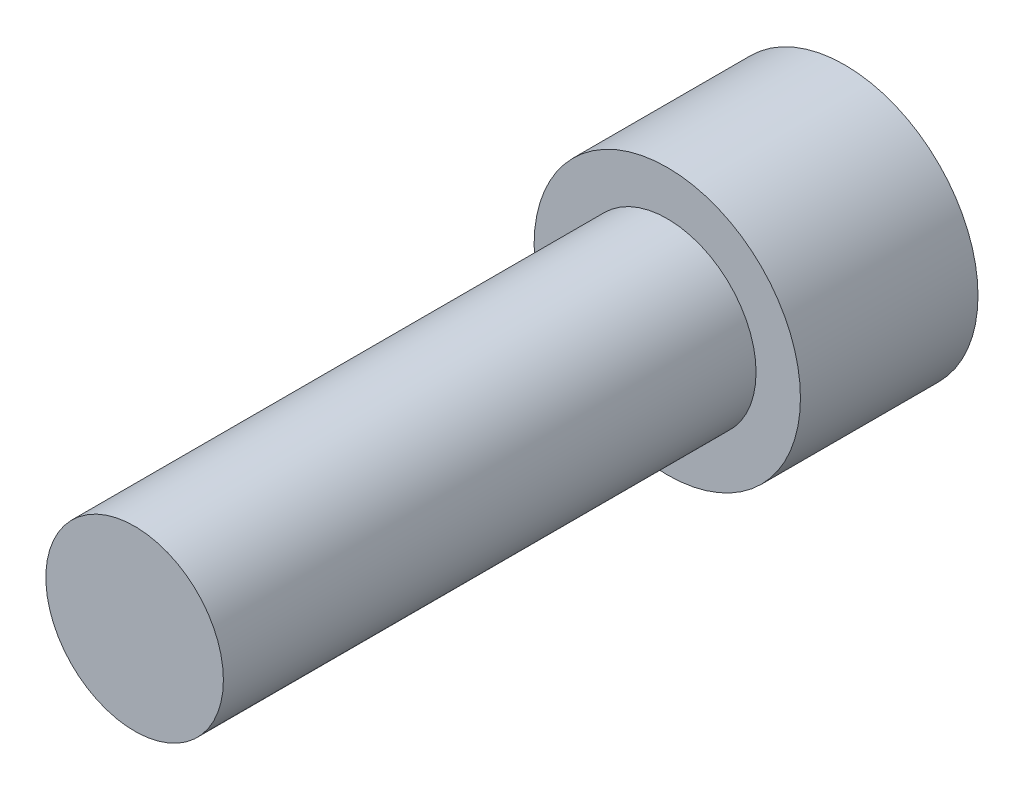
ISO-10303-21;
HEADER;
FILE_DESCRIPTION(('STEP AP214'),'2;1');
FILE_NAME('part.step','',(''),(''),'','','');
FILE_SCHEMA(('AUTOMOTIVE_DESIGN { 1 0 10303 214 1 1 1 1 }'));
ENDSEC;
DATA;
#1=APPLICATION_CONTEXT('core data for automotive mechanical design processes');
#2=APPLICATION_PROTOCOL_DEFINITION('international standard','automotive_design',2000,#1);
#3=PRODUCT_CONTEXT('',#1,'mechanical');
#4=PRODUCT('Part','Part','',(#3));
#5=PRODUCT_RELATED_PRODUCT_CATEGORY('part','',(#4));
#6=PRODUCT_DEFINITION_FORMATION('','',#4);
#7=PRODUCT_DEFINITION_CONTEXT('part definition',#1,'design');
#8=PRODUCT_DEFINITION('design','',#6,#7);
#9=PRODUCT_DEFINITION_SHAPE('','',#8);
#10=(LENGTH_UNIT() NAMED_UNIT(*) SI_UNIT(.MILLI.,.METRE.));
#11=(NAMED_UNIT(*) PLANE_ANGLE_UNIT() SI_UNIT($,.RADIAN.));
#12=(NAMED_UNIT(*) SI_UNIT($,.STERADIAN.) SOLID_ANGLE_UNIT());
#13=UNCERTAINTY_MEASURE_WITH_UNIT(LENGTH_MEASURE(1.E-05),#10,'distance_accuracy_value','');
#14=(GEOMETRIC_REPRESENTATION_CONTEXT(3) GLOBAL_UNCERTAINTY_ASSIGNED_CONTEXT((#13)) GLOBAL_UNIT_ASSIGNED_CONTEXT((#10,
#11,#12)) REPRESENTATION_CONTEXT('',''));
#15=CARTESIAN_POINT('',(0.,0.,0.));
#16=DIRECTION('',(0.,0.,1.));
#17=DIRECTION('',(1.,0.,0.));
#18=AXIS2_PLACEMENT_3D('',#15,#16,#17);
#19=CARTESIAN_POINT('',(0.,-4.7625,-6.35));
#20=DIRECTION('',(0.,0.,-1.));
#21=DIRECTION('',(-1.,0.,0.));
#22=AXIS2_PLACEMENT_3D('',#19,#20,#21);
#23=PLANE('',#22);
#24=DIRECTION('',(0.866025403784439,-0.5,0.));
#25=VECTOR('',#24,1.);
#26=CARTESIAN_POINT('',(0.,2.7569630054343,-6.35));
#27=LINE('',#26,#25);
#28=CARTESIAN_POINT('',(0.,2.7569630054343,-6.35));
#29=VERTEX_POINT('',#28);
#30=CARTESIAN_POINT('',(2.3876,1.37848150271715,-6.35));
#31=VERTEX_POINT('',#30);
#32=EDGE_CURVE('E46',#29,#31,#27,.T.);
#33=ORIENTED_EDGE('',*,*,#32,.F.);
#34=DIRECTION('',(0.866025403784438,0.5,0.));
#35=VECTOR('',#34,1.);
#36=CARTESIAN_POINT('',(-2.3876,1.37848150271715,-6.35));
#37=LINE('',#36,#35);
#38=CARTESIAN_POINT('',(-2.3876,1.37848150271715,-6.35));
#39=VERTEX_POINT('',#38);
#40=EDGE_CURVE('E129',#39,#29,#37,.T.);
#41=ORIENTED_EDGE('',*,*,#40,.F.);
#42=DIRECTION('',(0.,1.,0.));
#43=VECTOR('',#42,1.);
#44=CARTESIAN_POINT('',(-2.3876,-1.37848150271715,-6.35));
#45=LINE('',#44,#43);
#46=CARTESIAN_POINT('',(-2.3876,-1.37848150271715,-6.35));
#47=VERTEX_POINT('',#46);
#48=EDGE_CURVE('E127',#47,#39,#45,.T.);
#49=ORIENTED_EDGE('',*,*,#48,.F.);
#50=DIRECTION('',(-0.866025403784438,0.5,0.));
#51=VECTOR('',#50,1.);
#52=CARTESIAN_POINT('',(0.,-2.7569630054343,-6.35));
#53=LINE('',#52,#51);
#54=CARTESIAN_POINT('',(0.,-2.7569630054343,-6.35));
#55=VERTEX_POINT('',#54);
#56=EDGE_CURVE('E94',#55,#47,#53,.T.);
#57=ORIENTED_EDGE('',*,*,#56,.F.);
#58=DIRECTION('',(-0.866025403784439,-0.5,0.));
#59=VECTOR('',#58,1.);
#60=CARTESIAN_POINT('',(2.3876,-1.37848150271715,-6.35));
#61=LINE('',#60,#59);
#62=CARTESIAN_POINT('',(2.3876,-1.37848150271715,-6.35));
#63=VERTEX_POINT('',#62);
#64=EDGE_CURVE('E123',#63,#55,#61,.T.);
#65=ORIENTED_EDGE('',*,*,#64,.F.);
#66=DIRECTION('',(0.,-1.,0.));
#67=VECTOR('',#66,1.);
#68=CARTESIAN_POINT('',(2.3876,1.37848150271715,-6.35));
#69=LINE('',#68,#67);
#70=EDGE_CURVE('E120',#31,#63,#69,.T.);
#71=ORIENTED_EDGE('',*,*,#70,.F.);
#72=EDGE_LOOP('',(#33,#41,#49,#57,#65,#71));
#73=FACE_BOUND('',#72,.T.);
#74=CARTESIAN_POINT('',(0.,0.,-6.35));
#75=DIRECTION('',(0.,0.,1.));
#76=DIRECTION('',(1.,0.,0.));
#77=AXIS2_PLACEMENT_3D('',#74,#75,#76);
#78=CIRCLE('',#77,4.7625);
#79=CARTESIAN_POINT('',(4.7625,0.,-6.35));
#80=VERTEX_POINT('',#79);
#81=EDGE_CURVE('E11',#80,#80,#78,.T.);
#82=ORIENTED_EDGE('',*,*,#81,.F.);
#83=EDGE_LOOP('',(#82));
#84=FACE_BOUND('',#83,.T.);
#85=ADVANCED_FACE('F32',(#73,#84),#23,.T.);
#86=CARTESIAN_POINT('',(0.,0.,19.05));
#87=DIRECTION('',(0.,0.,1.));
#88=DIRECTION('',(1.,0.,0.));
#89=AXIS2_PLACEMENT_3D('',#86,#87,#88);
#90=CYLINDRICAL_SURFACE('',#89,4.7625);
#91=ORIENTED_EDGE('',*,*,#81,.T.);
#92=EDGE_LOOP('',(#91));
#93=FACE_BOUND('',#92,.T.);
#94=CARTESIAN_POINT('',(0.,0.,0.));
#95=DIRECTION('',(0.,0.,1.));
#96=DIRECTION('',(1.,0.,0.));
#97=AXIS2_PLACEMENT_3D('',#94,#95,#96);
#98=CIRCLE('',#97,4.7625);
#99=CARTESIAN_POINT('',(4.7625,0.,0.));
#100=VERTEX_POINT('',#99);
#101=EDGE_CURVE('E39',#100,#100,#98,.T.);
#102=ORIENTED_EDGE('',*,*,#101,.F.);
#103=EDGE_LOOP('',(#102));
#104=FACE_BOUND('',#103,.T.);
#105=ADVANCED_FACE('F149',(#93,#104),#90,.T.);
#106=CARTESIAN_POINT('',(0.,-3.175,0.));
#107=DIRECTION('',(0.,0.,1.));
#108=DIRECTION('',(1.,0.,0.));
#109=AXIS2_PLACEMENT_3D('',#106,#107,#108);
#110=PLANE('',#109);
#111=ORIENTED_EDGE('',*,*,#101,.T.);
#112=EDGE_LOOP('',(#111));
#113=FACE_BOUND('',#112,.T.);
#114=CARTESIAN_POINT('',(0.,0.,0.));
#115=DIRECTION('',(0.,0.,1.));
#116=DIRECTION('',(1.,0.,0.));
#117=AXIS2_PLACEMENT_3D('',#114,#115,#116);
#118=CIRCLE('',#117,3.175);
#119=CARTESIAN_POINT('',(3.175,0.,0.));
#120=VERTEX_POINT('',#119);
#121=EDGE_CURVE('E141',#120,#120,#118,.T.);
#122=ORIENTED_EDGE('',*,*,#121,.F.);
#123=EDGE_LOOP('',(#122));
#124=FACE_BOUND('',#123,.T.);
#125=ADVANCED_FACE('F146',(#113,#124),#110,.T.);
#126=CARTESIAN_POINT('',(0.,0.,19.05));
#127=DIRECTION('',(0.,0.,1.));
#128=DIRECTION('',(1.,0.,0.));
#129=AXIS2_PLACEMENT_3D('',#126,#127,#128);
#130=CYLINDRICAL_SURFACE('',#129,3.175);
#131=ORIENTED_EDGE('',*,*,#121,.T.);
#132=EDGE_LOOP('',(#131));
#133=FACE_BOUND('',#132,.T.);
#134=CARTESIAN_POINT('',(0.,0.,19.05));
#135=DIRECTION('',(0.,0.,1.));
#136=DIRECTION('',(1.,0.,0.));
#137=AXIS2_PLACEMENT_3D('',#134,#135,#136);
#138=CIRCLE('',#137,3.175);
#139=CARTESIAN_POINT('',(3.175,0.,19.05));
#140=VERTEX_POINT('',#139);
#141=EDGE_CURVE('E133',#140,#140,#138,.T.);
#142=ORIENTED_EDGE('',*,*,#141,.F.);
#143=EDGE_LOOP('',(#142));
#144=FACE_BOUND('',#143,.T.);
#145=ADVANCED_FACE('F156',(#133,#144),#130,.T.);
#146=CARTESIAN_POINT('',(0.,0.,19.05));
#147=DIRECTION('',(0.,0.,1.));
#148=DIRECTION('',(1.,0.,0.));
#149=AXIS2_PLACEMENT_3D('',#146,#147,#148);
#150=PLANE('',#149);
#151=ORIENTED_EDGE('',*,*,#141,.T.);
#152=EDGE_LOOP('',(#151));
#153=FACE_BOUND('',#152,.T.);
#154=ADVANCED_FACE('F162',(#153),#150,.T.);
#155=CARTESIAN_POINT('',(0.,2.7569630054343,-2.794));
#156=DIRECTION('',(0.5,0.866025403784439,0.));
#157=DIRECTION('',(-0.866025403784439,0.5,0.));
#158=AXIS2_PLACEMENT_3D('',#155,#156,#157);
#159=PLANE('',#158);
#160=ORIENTED_EDGE('',*,*,#32,.T.);
#161=DIRECTION('',(0.,0.,-1.));
#162=VECTOR('',#161,1.);
#163=CARTESIAN_POINT('',(2.3876,1.37848150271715,-2.794));
#164=LINE('',#163,#162);
#165=CARTESIAN_POINT('',(2.3876,1.37848150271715,-2.794));
#166=VERTEX_POINT('',#165);
#167=EDGE_CURVE('E76',#166,#31,#164,.T.);
#168=ORIENTED_EDGE('',*,*,#167,.F.);
#169=DIRECTION('',(0.866025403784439,-0.5,0.));
#170=VECTOR('',#169,1.);
#171=CARTESIAN_POINT('',(0.,2.7569630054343,-2.794));
#172=LINE('',#171,#170);
#173=CARTESIAN_POINT('',(0.,2.7569630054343,-2.794));
#174=VERTEX_POINT('',#173);
#175=EDGE_CURVE('E131',#174,#166,#172,.T.);
#176=ORIENTED_EDGE('',*,*,#175,.F.);
#177=DIRECTION('',(0.,0.,-1.));
#178=VECTOR('',#177,1.);
#179=CARTESIAN_POINT('',(0.,2.7569630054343,-2.794));
#180=LINE('',#179,#178);
#181=EDGE_CURVE('E54',#174,#29,#180,.T.);
#182=ORIENTED_EDGE('',*,*,#181,.T.);
#183=EDGE_LOOP('',(#160,#168,#176,#182));
#184=FACE_BOUND('',#183,.T.);
#185=ADVANCED_FACE('F166',(#184),#159,.F.);
#186=CARTESIAN_POINT('',(-2.3876,1.37848150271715,-2.794));
#187=DIRECTION('',(-0.5,0.866025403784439,0.));
#188=DIRECTION('',(-0.866025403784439,-0.5,0.));
#189=AXIS2_PLACEMENT_3D('',#186,#187,#188);
#190=PLANE('',#189);
#191=ORIENTED_EDGE('',*,*,#40,.T.);
#192=ORIENTED_EDGE('',*,*,#181,.F.);
#193=DIRECTION('',(0.866025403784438,0.5,0.));
#194=VECTOR('',#193,1.);
#195=CARTESIAN_POINT('',(-2.3876,1.37848150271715,-2.794));
#196=LINE('',#195,#194);
#197=CARTESIAN_POINT('',(-2.3876,1.37848150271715,-2.794));
#198=VERTEX_POINT('',#197);
#199=EDGE_CURVE('E106',#198,#174,#196,.T.);
#200=ORIENTED_EDGE('',*,*,#199,.F.);
#201=DIRECTION('',(0.,0.,-1.));
#202=VECTOR('',#201,1.);
#203=CARTESIAN_POINT('',(-2.3876,1.37848150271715,-2.794));
#204=LINE('',#203,#202);
#205=EDGE_CURVE('E98',#198,#39,#204,.T.);
#206=ORIENTED_EDGE('',*,*,#205,.T.);
#207=EDGE_LOOP('',(#191,#192,#200,#206));
#208=FACE_BOUND('',#207,.T.);
#209=ADVANCED_FACE('F170',(#208),#190,.F.);
#210=CARTESIAN_POINT('',(-2.3876,-1.37848150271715,-2.794));
#211=DIRECTION('',(-1.,0.,0.));
#212=DIRECTION('',(0.,0.,1.));
#213=AXIS2_PLACEMENT_3D('',#210,#211,#212);
#214=PLANE('',#213);
#215=ORIENTED_EDGE('',*,*,#48,.T.);
#216=ORIENTED_EDGE('',*,*,#205,.F.);
#217=DIRECTION('',(0.,1.,0.));
#218=VECTOR('',#217,1.);
#219=CARTESIAN_POINT('',(-2.3876,-1.37848150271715,-2.794));
#220=LINE('',#219,#218);
#221=CARTESIAN_POINT('',(-2.3876,-1.37848150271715,-2.794));
#222=VERTEX_POINT('',#221);
#223=EDGE_CURVE('E102',#222,#198,#220,.T.);
#224=ORIENTED_EDGE('',*,*,#223,.F.);
#225=DIRECTION('',(0.,0.,-1.));
#226=VECTOR('',#225,1.);
#227=CARTESIAN_POINT('',(-2.3876,-1.37848150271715,-2.794));
#228=LINE('',#227,#226);
#229=EDGE_CURVE('E87',#222,#47,#228,.T.);
#230=ORIENTED_EDGE('',*,*,#229,.T.);
#231=EDGE_LOOP('',(#215,#216,#224,#230));
#232=FACE_BOUND('',#231,.T.);
#233=ADVANCED_FACE('F103',(#232),#214,.F.);
#234=CARTESIAN_POINT('',(0.,-2.7569630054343,-2.794));
#235=DIRECTION('',(-0.5,-0.866025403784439,0.));
#236=DIRECTION('',(0.866025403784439,-0.5,0.));
#237=AXIS2_PLACEMENT_3D('',#234,#235,#236);
#238=PLANE('',#237);
#239=ORIENTED_EDGE('',*,*,#56,.T.);
#240=ORIENTED_EDGE('',*,*,#229,.F.);
#241=DIRECTION('',(-0.866025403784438,0.5,0.));
#242=VECTOR('',#241,1.);
#243=CARTESIAN_POINT('',(0.,-2.7569630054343,-2.794));
#244=LINE('',#243,#242);
#245=CARTESIAN_POINT('',(0.,-2.7569630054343,-2.794));
#246=VERTEX_POINT('',#245);
#247=EDGE_CURVE('E91',#246,#222,#244,.T.);
#248=ORIENTED_EDGE('',*,*,#247,.F.);
#249=DIRECTION('',(0.,0.,-1.));
#250=VECTOR('',#249,1.);
#251=CARTESIAN_POINT('',(0.,-2.7569630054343,-2.794));
#252=LINE('',#251,#250);
#253=EDGE_CURVE('E99',#246,#55,#252,.T.);
#254=ORIENTED_EDGE('',*,*,#253,.T.);
#255=EDGE_LOOP('',(#239,#240,#248,#254));
#256=FACE_BOUND('',#255,.T.);
#257=ADVANCED_FACE('F89',(#256),#238,.F.);
#258=CARTESIAN_POINT('',(2.3876,-1.37848150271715,-2.794));
#259=DIRECTION('',(0.5,-0.866025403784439,0.));
#260=DIRECTION('',(0.866025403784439,0.5,0.));
#261=AXIS2_PLACEMENT_3D('',#258,#259,#260);
#262=PLANE('',#261);
#263=ORIENTED_EDGE('',*,*,#64,.T.);
#264=ORIENTED_EDGE('',*,*,#253,.F.);
#265=DIRECTION('',(-0.866025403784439,-0.5,0.));
#266=VECTOR('',#265,1.);
#267=CARTESIAN_POINT('',(2.3876,-1.37848150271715,-2.794));
#268=LINE('',#267,#266);
#269=CARTESIAN_POINT('',(2.3876,-1.37848150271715,-2.794));
#270=VERTEX_POINT('',#269);
#271=EDGE_CURVE('E112',#270,#246,#268,.T.);
#272=ORIENTED_EDGE('',*,*,#271,.F.);
#273=DIRECTION('',(0.,0.,-1.));
#274=VECTOR('',#273,1.);
#275=CARTESIAN_POINT('',(2.3876,-1.37848150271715,-2.794));
#276=LINE('',#275,#274);
#277=EDGE_CURVE('E136',#270,#63,#276,.T.);
#278=ORIENTED_EDGE('',*,*,#277,.T.);
#279=EDGE_LOOP('',(#263,#264,#272,#278));
#280=FACE_BOUND('',#279,.T.);
#281=ADVANCED_FACE('F174',(#280),#262,.F.);
#282=CARTESIAN_POINT('',(2.3876,1.37848150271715,-2.794));
#283=DIRECTION('',(1.,0.,0.));
#284=DIRECTION('',(0.,0.,-1.));
#285=AXIS2_PLACEMENT_3D('',#282,#283,#284);
#286=PLANE('',#285);
#287=ORIENTED_EDGE('',*,*,#70,.T.);
#288=ORIENTED_EDGE('',*,*,#277,.F.);
#289=DIRECTION('',(0.,-1.,0.));
#290=VECTOR('',#289,1.);
#291=CARTESIAN_POINT('',(2.3876,1.37848150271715,-2.794));
#292=LINE('',#291,#290);
#293=EDGE_CURVE('E114',#166,#270,#292,.T.);
#294=ORIENTED_EDGE('',*,*,#293,.F.);
#295=ORIENTED_EDGE('',*,*,#167,.T.);
#296=EDGE_LOOP('',(#287,#288,#294,#295));
#297=FACE_BOUND('',#296,.T.);
#298=ADVANCED_FACE('F171',(#297),#286,.F.);
#299=CARTESIAN_POINT('',(0.,2.7569630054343,-2.794));
#300=DIRECTION('',(0.,0.,1.));
#301=DIRECTION('',(1.,0.,0.));
#302=AXIS2_PLACEMENT_3D('',#299,#300,#301);
#303=PLANE('',#302);
#304=ORIENTED_EDGE('',*,*,#175,.T.);
#305=ORIENTED_EDGE('',*,*,#293,.T.);
#306=ORIENTED_EDGE('',*,*,#271,.T.);
#307=ORIENTED_EDGE('',*,*,#247,.T.);
#308=ORIENTED_EDGE('',*,*,#223,.T.);
#309=ORIENTED_EDGE('',*,*,#199,.T.);
#310=EDGE_LOOP('',(#304,#305,#306,#307,#308,#309));
#311=FACE_BOUND('',#310,.T.);
#312=ADVANCED_FACE('F109',(#311),#303,.F.);
#313=CLOSED_SHELL('',(#85,#105,#125,#145,#154,#185,#209,#233,#257,#281,#298,#312));
#314=MANIFOLD_SOLID_BREP('B2',#313);
#315=ADVANCED_BREP_SHAPE_REPRESENTATION('',(#18,#314),#14);
#316=SHAPE_DEFINITION_REPRESENTATION(#9,#315);
ENDSEC;
END-ISO-10303-21;
